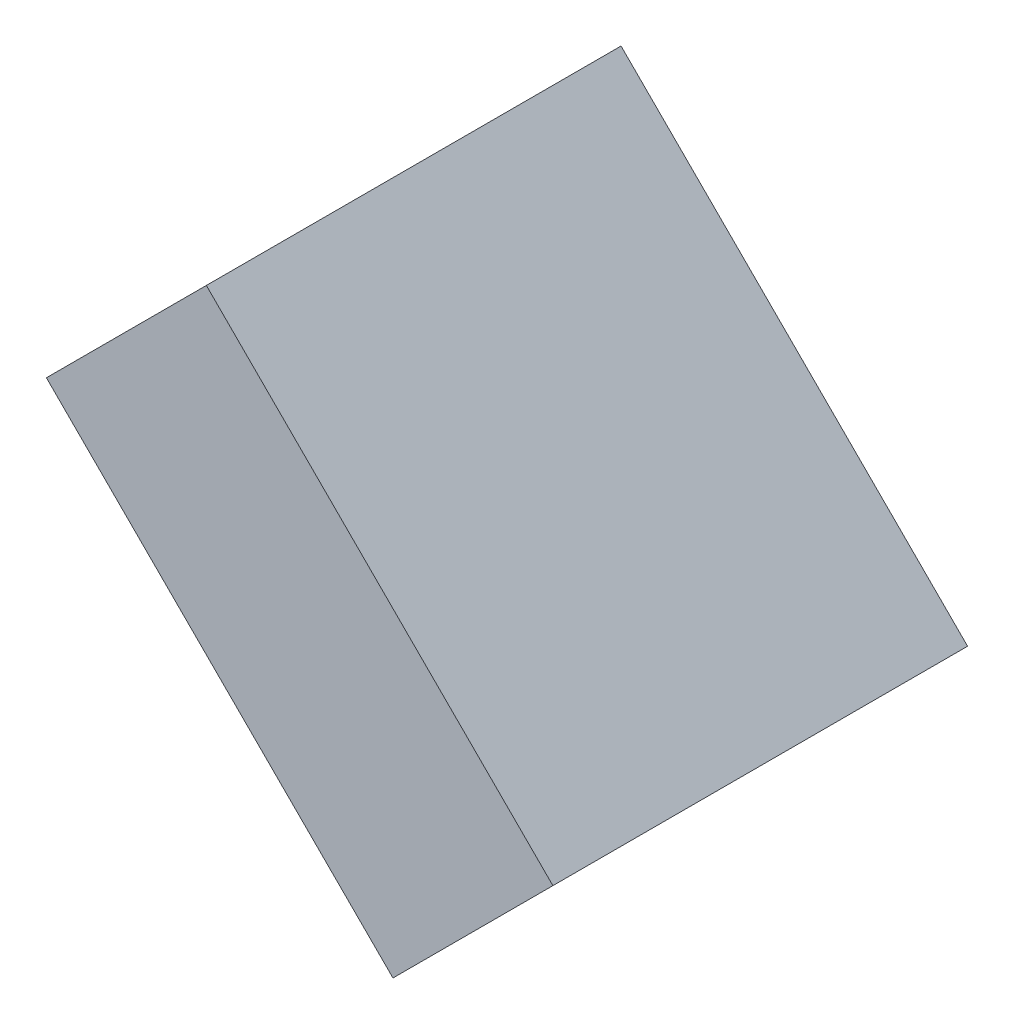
ISO-10303-21;
HEADER;
FILE_DESCRIPTION(('STEP AP214'),'2;1');
FILE_NAME('part.step','',(''),(''),'','','');
FILE_SCHEMA(('AUTOMOTIVE_DESIGN { 1 0 10303 214 1 1 1 1 }'));
ENDSEC;
DATA;
#1=APPLICATION_CONTEXT('core data for automotive mechanical design processes');
#2=APPLICATION_PROTOCOL_DEFINITION('international standard','automotive_design',2000,#1);
#3=PRODUCT_CONTEXT('',#1,'mechanical');
#4=PRODUCT('Part','Part','',(#3));
#5=PRODUCT_RELATED_PRODUCT_CATEGORY('part','',(#4));
#6=PRODUCT_DEFINITION_FORMATION('','',#4);
#7=PRODUCT_DEFINITION_CONTEXT('part definition',#1,'design');
#8=PRODUCT_DEFINITION('design','',#6,#7);
#9=PRODUCT_DEFINITION_SHAPE('','',#8);
#10=(LENGTH_UNIT() NAMED_UNIT(*) SI_UNIT(.MILLI.,.METRE.));
#11=(NAMED_UNIT(*) PLANE_ANGLE_UNIT() SI_UNIT($,.RADIAN.));
#12=(NAMED_UNIT(*) SI_UNIT($,.STERADIAN.) SOLID_ANGLE_UNIT());
#13=UNCERTAINTY_MEASURE_WITH_UNIT(LENGTH_MEASURE(1.E-05),#10,'distance_accuracy_value','');
#14=(GEOMETRIC_REPRESENTATION_CONTEXT(3) GLOBAL_UNCERTAINTY_ASSIGNED_CONTEXT((#13)) GLOBAL_UNIT_ASSIGNED_CONTEXT((#10,
#11,#12)) REPRESENTATION_CONTEXT('',''));
#15=CARTESIAN_POINT('',(0.,0.,0.));
#16=DIRECTION('',(0.,0.,1.));
#17=DIRECTION('',(1.,0.,0.));
#18=AXIS2_PLACEMENT_3D('',#15,#16,#17);
#19=CARTESIAN_POINT('',(1.26999999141E-06,1.270000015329E-06,0.5499989));
#20=DIRECTION('',(0.,0.,1.));
#21=DIRECTION('',(1.,0.,0.));
#22=AXIS2_PLACEMENT_3D('',#19,#20,#21);
#23=PLANE('',#22);
#24=DIRECTION('',(-0.707106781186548,0.707106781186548,0.));
#25=VECTOR('',#24,1.);
#26=CARTESIAN_POINT('',(0.3358769,-0.12374372,0.5499989));
#27=LINE('',#26,#25);
#28=CARTESIAN_POINT('',(0.3358769,-0.12374372,0.5499989));
#29=VERTEX_POINT('',#28);
#30=CARTESIAN_POINT('',(-0.12374372,0.3358769,0.5499989));
#31=VERTEX_POINT('',#30);
#32=EDGE_CURVE('E91',#29,#31,#27,.T.);
#33=ORIENTED_EDGE('',*,*,#32,.T.);
#34=DIRECTION('',(-0.707106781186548,-0.707106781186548,0.));
#35=VECTOR('',#34,1.);
#36=CARTESIAN_POINT('',(-0.12374372,0.3358769,0.5499989));
#37=LINE('',#36,#35);
#38=CARTESIAN_POINT('',(-0.33587436,0.12374626,0.5499989));
#39=VERTEX_POINT('',#38);
#40=EDGE_CURVE('E69',#31,#39,#37,.T.);
#41=ORIENTED_EDGE('',*,*,#40,.T.);
#42=DIRECTION('',(0.707106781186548,-0.707106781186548,0.));
#43=VECTOR('',#42,1.);
#44=CARTESIAN_POINT('',(-0.33587436,0.12374626,0.5499989));
#45=LINE('',#44,#43);
#46=CARTESIAN_POINT('',(0.12374626,-0.33587436,0.5499989));
#47=VERTEX_POINT('',#46);
#48=EDGE_CURVE('E74',#39,#47,#45,.T.);
#49=ORIENTED_EDGE('',*,*,#48,.T.);
#50=DIRECTION('',(0.707106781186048,0.707106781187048,0.));
#51=VECTOR('',#50,1.);
#52=CARTESIAN_POINT('',(0.12374626,-0.33587436,0.5499989));
#53=LINE('',#52,#51);
#54=EDGE_CURVE('E11',#47,#29,#53,.T.);
#55=ORIENTED_EDGE('',*,*,#54,.T.);
#56=EDGE_LOOP('',(#33,#41,#49,#55));
#57=FACE_BOUND('',#56,.T.);
#58=ADVANCED_FACE('F17',(#57),#23,.T.);
#59=CARTESIAN_POINT('',(1.26999999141E-06,1.270000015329E-06,0.));
#60=DIRECTION('',(0.,0.,1.));
#61=DIRECTION('',(1.,0.,0.));
#62=AXIS2_PLACEMENT_3D('',#59,#60,#61);
#63=PLANE('',#62);
#64=DIRECTION('',(0.707106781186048,0.707106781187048,0.));
#65=VECTOR('',#64,1.);
#66=CARTESIAN_POINT('',(0.12374626,-0.33587436,0.));
#67=LINE('',#66,#65);
#68=CARTESIAN_POINT('',(0.12374626,-0.33587436,0.));
#69=VERTEX_POINT('',#68);
#70=CARTESIAN_POINT('',(0.3358769,-0.12374372,0.));
#71=VERTEX_POINT('',#70);
#72=EDGE_CURVE('E26',#69,#71,#67,.T.);
#73=ORIENTED_EDGE('',*,*,#72,.F.);
#74=DIRECTION('',(0.707106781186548,-0.707106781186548,0.));
#75=VECTOR('',#74,1.);
#76=CARTESIAN_POINT('',(-0.33587436,0.12374626,0.));
#77=LINE('',#76,#75);
#78=CARTESIAN_POINT('',(-0.33587436,0.12374626,0.));
#79=VERTEX_POINT('',#78);
#80=EDGE_CURVE('E56',#79,#69,#77,.T.);
#81=ORIENTED_EDGE('',*,*,#80,.F.);
#82=DIRECTION('',(-0.707106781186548,-0.707106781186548,0.));
#83=VECTOR('',#82,1.);
#84=CARTESIAN_POINT('',(-0.12374372,0.3358769,0.));
#85=LINE('',#84,#83);
#86=CARTESIAN_POINT('',(-0.12374372,0.3358769,0.));
#87=VERTEX_POINT('',#86);
#88=EDGE_CURVE('E62',#87,#79,#85,.T.);
#89=ORIENTED_EDGE('',*,*,#88,.F.);
#90=DIRECTION('',(-0.707106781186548,0.707106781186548,0.));
#91=VECTOR('',#90,1.);
#92=CARTESIAN_POINT('',(0.3358769,-0.12374372,0.));
#93=LINE('',#92,#91);
#94=EDGE_CURVE('E114',#71,#87,#93,.T.);
#95=ORIENTED_EDGE('',*,*,#94,.F.);
#96=EDGE_LOOP('',(#73,#81,#89,#95));
#97=FACE_BOUND('',#96,.T.);
#98=ADVANCED_FACE('F58',(#97),#63,.F.);
#99=CARTESIAN_POINT('',(0.12374626,-0.33587436,0.));
#100=DIRECTION('',(-0.707106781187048,0.707106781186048,0.));
#101=DIRECTION('',(0.,0.,1.));
#102=AXIS2_PLACEMENT_3D('',#99,#100,#101);
#103=PLANE('',#102);
#104=ORIENTED_EDGE('',*,*,#72,.T.);
#105=DIRECTION('',(0.,0.,1.));
#106=VECTOR('',#105,1.);
#107=CARTESIAN_POINT('',(0.3358769,-0.12374372,0.));
#108=LINE('',#107,#106);
#109=EDGE_CURVE('E85',#71,#29,#108,.T.);
#110=ORIENTED_EDGE('',*,*,#109,.T.);
#111=ORIENTED_EDGE('',*,*,#54,.F.);
#112=DIRECTION('',(0.,0.,1.));
#113=VECTOR('',#112,1.);
#114=CARTESIAN_POINT('',(0.12374626,-0.33587436,0.));
#115=LINE('',#114,#113);
#116=EDGE_CURVE('E68',#69,#47,#115,.T.);
#117=ORIENTED_EDGE('',*,*,#116,.F.);
#118=EDGE_LOOP('',(#104,#110,#111,#117));
#119=FACE_BOUND('',#118,.T.);
#120=ADVANCED_FACE('F106',(#119),#103,.F.);
#121=CARTESIAN_POINT('',(-0.33587436,0.12374626,0.));
#122=DIRECTION('',(0.707106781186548,0.707106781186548,0.));
#123=DIRECTION('',(0.,0.,-1.));
#124=AXIS2_PLACEMENT_3D('',#121,#122,#123);
#125=PLANE('',#124);
#126=ORIENTED_EDGE('',*,*,#80,.T.);
#127=ORIENTED_EDGE('',*,*,#116,.T.);
#128=ORIENTED_EDGE('',*,*,#48,.F.);
#129=DIRECTION('',(0.,0.,1.));
#130=VECTOR('',#129,1.);
#131=CARTESIAN_POINT('',(-0.33587436,0.12374626,0.));
#132=LINE('',#131,#130);
#133=EDGE_CURVE('E72',#79,#39,#132,.T.);
#134=ORIENTED_EDGE('',*,*,#133,.F.);
#135=EDGE_LOOP('',(#126,#127,#128,#134));
#136=FACE_BOUND('',#135,.T.);
#137=ADVANCED_FACE('F73',(#136),#125,.F.);
#138=CARTESIAN_POINT('',(-0.12374372,0.3358769,0.));
#139=DIRECTION('',(0.707106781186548,-0.707106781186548,0.));
#140=DIRECTION('',(0.,0.,-1.));
#141=AXIS2_PLACEMENT_3D('',#138,#139,#140);
#142=PLANE('',#141);
#143=ORIENTED_EDGE('',*,*,#88,.T.);
#144=ORIENTED_EDGE('',*,*,#133,.T.);
#145=ORIENTED_EDGE('',*,*,#40,.F.);
#146=DIRECTION('',(0.,0.,1.));
#147=VECTOR('',#146,1.);
#148=CARTESIAN_POINT('',(-0.12374372,0.3358769,0.));
#149=LINE('',#148,#147);
#150=EDGE_CURVE('E82',#87,#31,#149,.T.);
#151=ORIENTED_EDGE('',*,*,#150,.F.);
#152=EDGE_LOOP('',(#143,#144,#145,#151));
#153=FACE_BOUND('',#152,.T.);
#154=ADVANCED_FACE('F80',(#153),#142,.F.);
#155=CARTESIAN_POINT('',(0.3358769,-0.12374372,0.));
#156=DIRECTION('',(-0.707106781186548,-0.707106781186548,0.));
#157=DIRECTION('',(-0.707106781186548,0.707106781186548,0.));
#158=AXIS2_PLACEMENT_3D('',#155,#156,#157);
#159=PLANE('',#158);
#160=ORIENTED_EDGE('',*,*,#94,.T.);
#161=ORIENTED_EDGE('',*,*,#150,.T.);
#162=ORIENTED_EDGE('',*,*,#32,.F.);
#163=ORIENTED_EDGE('',*,*,#109,.F.);
#164=EDGE_LOOP('',(#160,#161,#162,#163));
#165=FACE_BOUND('',#164,.T.);
#166=ADVANCED_FACE('F113',(#165),#159,.F.);
#167=CLOSED_SHELL('',(#58,#98,#120,#137,#154,#166));
#168=MANIFOLD_SOLID_BREP('B1',#167);
#169=ADVANCED_BREP_SHAPE_REPRESENTATION('',(#18,#168),#14);
#170=SHAPE_DEFINITION_REPRESENTATION(#9,#169);
ENDSEC;
END-ISO-10303-21;
